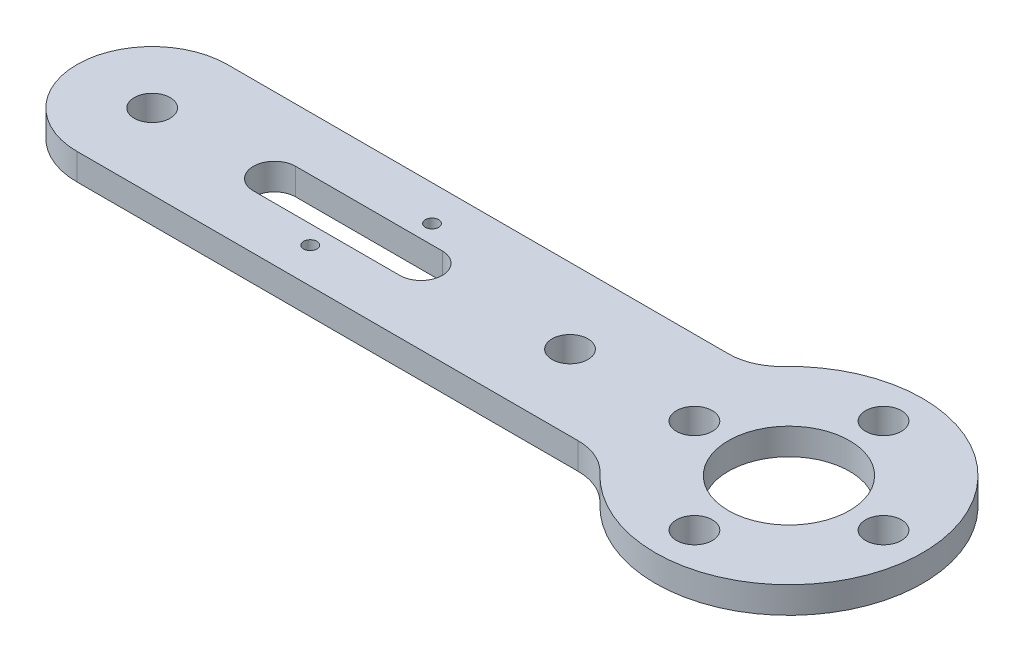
from build123d import *

# Parameters (mm, degrees)
SKETCH1_R             = 7.25
BOSS_EXTRUDE1_DEPTH   = 3.175
M4_CLEARANCE_HOLE1_D  = 4.3
M4_CLEARANCE_HOLE2_D  = 4.3
FILLET1_R             = 6.35
CUT_EXTRUDE1_DEPTH    = 87.747453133
M2X0_4_TAPPED_HOLE1_D = 1.6


with BuildPart() as part:
    # Sketch1 → Boss-Extrude1 (new body)
    with BuildSketch(Plane(origin=(0, 0, 0), x_dir=(1, 0, 0), z_dir=(0, 1, 0))):
        with BuildLine():
            Line((-76.2, 9), (-13.228756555, 9))
            ThreePointArc((-13.228756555, 9), (16, 0), (-13.228756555, -9))
            Line((-13.228756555, -9), (-76.2, -9))
            ThreePointArc((-76.2, -9), (-85.2, 0), (-76.2, 9))
        make_face()
        with Locations(Location((0, 0, 0), (0, 0, 270))):
            Circle(SKETCH1_R, mode=Mode.SUBTRACT)
    extrude(amount=BOSS_EXTRUDE1_DEPTH)

    # M4 Clearance Hole1 (through all)
    with Locations(Plane(origin=(0, 3.175, 0), x_dir=(1, 0, 0), z_dir=(0, 1, 0))):
        with Locations((0, 11.313708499), (0, -11.313708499), (11.313708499, 0), (-11.313708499, 0)):
            Hole(M4_CLEARANCE_HOLE1_D / 2)

    # M4 Clearance Hole2 (through all)
    with Locations(Plane(origin=(0, 3.175, 0), x_dir=(1, 0, 0), z_dir=(0, 1, 0))):
        with Locations((-76.2, 0), (-26.2, 0)):
            Hole(M4_CLEARANCE_HOLE2_D / 2)

    # Fillet1
    fillet1_edges = [part.edges().sort_by_distance(p)[0] for p in [
        (-13.228756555, 1.5875, -9),
        (-13.228756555, 1.5875, 9),
    ]]
    fillet(fillet1_edges, radius=FILLET1_R)

    # Sketch8 → Cut-Extrude1 (cut, through all)
    with BuildSketch(Plane(origin=(0, 3.175, 0), x_dir=(1, 0, 0), z_dir=(0, 1, 0))):
        with BuildLine():
            Line((-44.02694, -2.54), (-61.56106, -2.54))
            ThreePointArc((-61.56106, -2.54), (-64.10106, 0), (-61.56106, 2.54))
            Line((-61.56106, 2.54), (-44.02694, 2.54))
            ThreePointArc((-44.02694, 2.54), (-41.48694, 0), (-44.02694, -2.54))
        make_face()
    extrude(amount=-CUT_EXTRUDE1_DEPTH, mode=Mode.SUBTRACT)

    # M2x0.4 Tapped Hole1 (through all)
    with Locations(Plane(origin=(0, 3.175, 0), x_dir=(1, 0, 0), z_dir=(0, 1, 0))):
        with Locations((-47.48134, 4.76218), (-52.5207, -4.76282)):
            Hole(M2X0_4_TAPPED_HOLE1_D / 2)


solid = part.part
